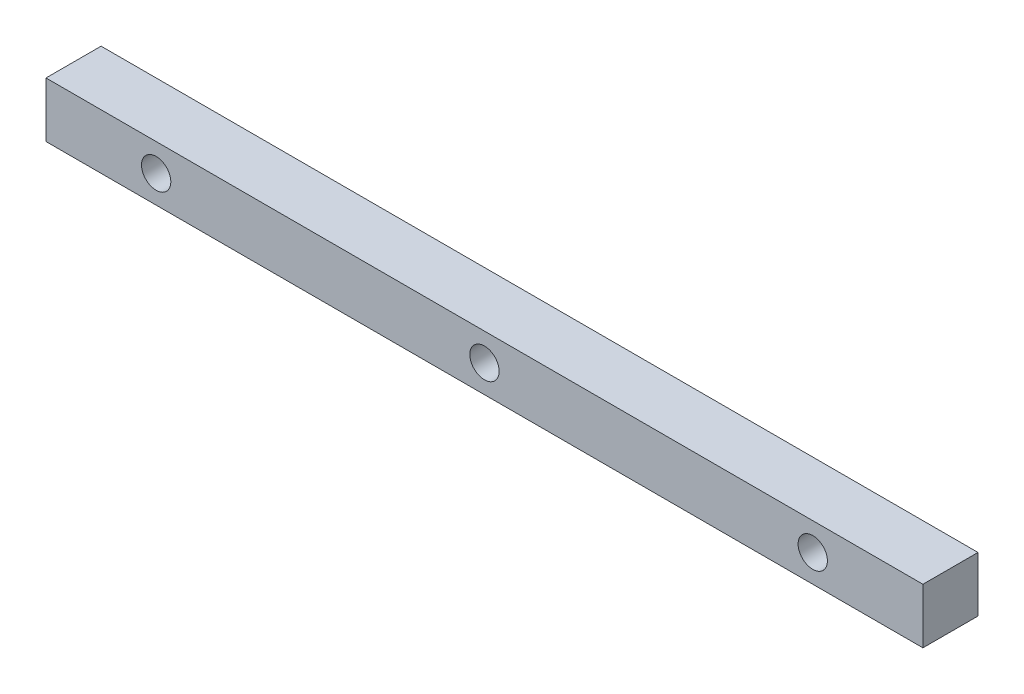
from build123d import *

# Parameters (mm, degrees)
SKETCH1_W      = 202.184
SKETCH1_H      = 12.7
SKETCH1_R      = 3.3782
EXTRUDE1_DEPTH = 12.7


with BuildPart() as part:
    # Sketch1 → Extrude1 (new body)
    with BuildSketch(Plane.XY):
        with Locations((-101.092, -6.35)):
            Rectangle(SKETCH1_W, SKETCH1_H)
        with Locations((-25.4, -6.35)):
            Circle(SKETCH1_R, mode=Mode.SUBTRACT)
        with Locations((-101.092, -6.35)):
            Circle(SKETCH1_R, mode=Mode.SUBTRACT)
        with Locations((-176.784, -6.35)):
            Circle(SKETCH1_R, mode=Mode.SUBTRACT)
    extrude(amount=EXTRUDE1_DEPTH)


solid = part.part
